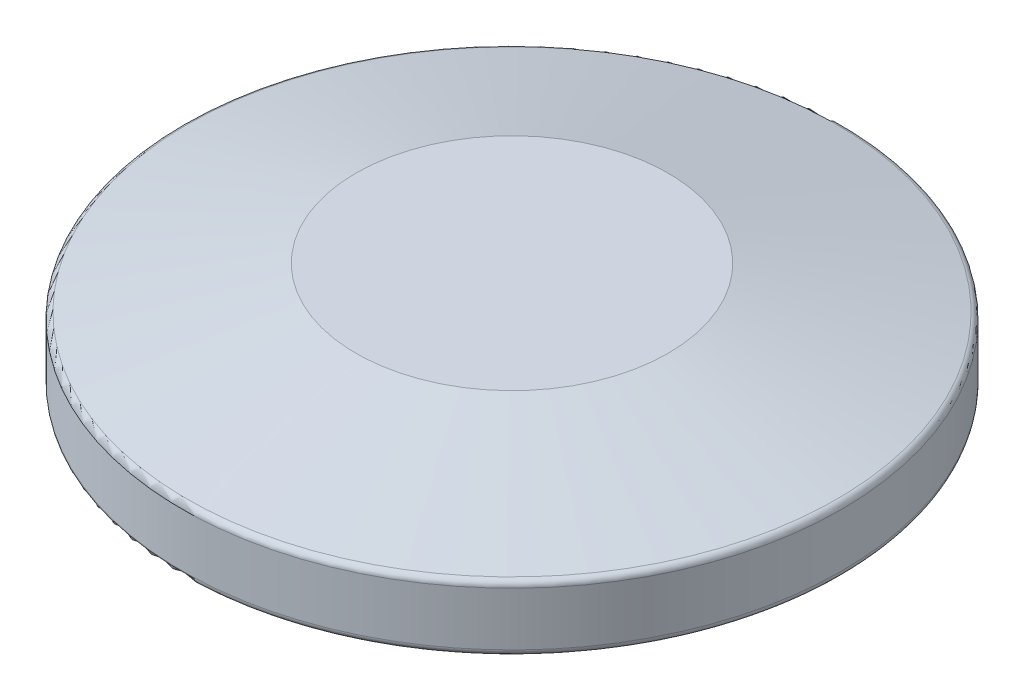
ISO-10303-21;
HEADER;
FILE_DESCRIPTION(('STEP AP214'),'2;1');
FILE_NAME('part.step','',(''),(''),'','','');
FILE_SCHEMA(('AUTOMOTIVE_DESIGN { 1 0 10303 214 1 1 1 1 }'));
ENDSEC;
DATA;
#1=APPLICATION_CONTEXT('core data for automotive mechanical design processes');
#2=APPLICATION_PROTOCOL_DEFINITION('international standard','automotive_design',2000,#1);
#3=PRODUCT_CONTEXT('',#1,'mechanical');
#4=PRODUCT('Part','Part','',(#3));
#5=PRODUCT_RELATED_PRODUCT_CATEGORY('part','',(#4));
#6=PRODUCT_DEFINITION_FORMATION('','',#4);
#7=PRODUCT_DEFINITION_CONTEXT('part definition',#1,'design');
#8=PRODUCT_DEFINITION('design','',#6,#7);
#9=PRODUCT_DEFINITION_SHAPE('','',#8);
#10=(LENGTH_UNIT() NAMED_UNIT(*) SI_UNIT(.MILLI.,.METRE.));
#11=(NAMED_UNIT(*) PLANE_ANGLE_UNIT() SI_UNIT($,.RADIAN.));
#12=(NAMED_UNIT(*) SI_UNIT($,.STERADIAN.) SOLID_ANGLE_UNIT());
#13=UNCERTAINTY_MEASURE_WITH_UNIT(LENGTH_MEASURE(1.E-05),#10,'distance_accuracy_value','');
#14=(GEOMETRIC_REPRESENTATION_CONTEXT(3) GLOBAL_UNCERTAINTY_ASSIGNED_CONTEXT((#13)) GLOBAL_UNIT_ASSIGNED_CONTEXT((#10,
#11,#12)) REPRESENTATION_CONTEXT('',''));
#15=CARTESIAN_POINT('',(0.,0.,0.));
#16=DIRECTION('',(0.,0.,1.));
#17=DIRECTION('',(1.,0.,0.));
#18=AXIS2_PLACEMENT_3D('',#15,#16,#17);
#19=CARTESIAN_POINT('',(0.,0.1,0.));
#20=DIRECTION('',(0.,1.,0.));
#21=DIRECTION('',(-1.,0.,0.));
#22=AXIS2_PLACEMENT_3D('',#19,#20,#21);
#23=TOROIDAL_SURFACE('',#22,3.525,0.1);
#24=CARTESIAN_POINT('',(0.,0.1,0.));
#25=DIRECTION('',(0.,1.,0.));
#26=DIRECTION('',(-1.,0.,0.));
#27=AXIS2_PLACEMENT_3D('',#24,#25,#26);
#28=CIRCLE('',#27,3.625);
#29=CARTESIAN_POINT('',(-3.625,0.1,0.));
#30=VERTEX_POINT('',#29);
#31=EDGE_CURVE('E52',#30,#30,#28,.T.);
#32=ORIENTED_EDGE('',*,*,#31,.F.);
#33=EDGE_LOOP('',(#32));
#34=FACE_BOUND('',#33,.T.);
#35=CARTESIAN_POINT('',(0.,0.,0.));
#36=DIRECTION('',(0.,1.,0.));
#37=DIRECTION('',(-1.,0.,0.));
#38=AXIS2_PLACEMENT_3D('',#35,#36,#37);
#39=CIRCLE('',#38,3.525);
#40=CARTESIAN_POINT('',(-3.525,0.,0.));
#41=VERTEX_POINT('',#40);
#42=EDGE_CURVE('E10',#41,#41,#39,.F.);
#43=ORIENTED_EDGE('',*,*,#42,.F.);
#44=EDGE_LOOP('',(#43));
#45=FACE_BOUND('',#44,.T.);
#46=ADVANCED_FACE('F45',(#34,#45),#23,.T.);
#47=CARTESIAN_POINT('',(0.,0.299999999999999,0.));
#48=DIRECTION('',(0.,1.,0.));
#49=DIRECTION('',(-1.,0.,0.));
#50=AXIS2_PLACEMENT_3D('',#47,#48,#49);
#51=TOROIDAL_SURFACE('',#50,6.5,0.3);
#52=CARTESIAN_POINT('',(0.,0.,0.));
#53=DIRECTION('',(0.,1.,0.));
#54=DIRECTION('',(-1.,0.,0.));
#55=AXIS2_PLACEMENT_3D('',#52,#53,#54);
#56=CIRCLE('',#55,6.5);
#57=CARTESIAN_POINT('',(-6.5,0.,0.));
#58=VERTEX_POINT('',#57);
#59=EDGE_CURVE('E62',#58,#58,#56,.T.);
#60=ORIENTED_EDGE('',*,*,#59,.F.);
#61=EDGE_LOOP('',(#60));
#62=FACE_BOUND('',#61,.T.);
#63=CARTESIAN_POINT('',(0.,0.299999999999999,0.));
#64=DIRECTION('',(0.,1.,0.));
#65=DIRECTION('',(-1.,0.,0.));
#66=AXIS2_PLACEMENT_3D('',#63,#64,#65);
#67=CIRCLE('',#66,6.2);
#68=CARTESIAN_POINT('',(-6.2,0.299999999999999,0.));
#69=VERTEX_POINT('',#68);
#70=EDGE_CURVE('E57',#69,#69,#67,.F.);
#71=ORIENTED_EDGE('',*,*,#70,.F.);
#72=EDGE_LOOP('',(#71));
#73=FACE_BOUND('',#72,.T.);
#74=ADVANCED_FACE('F116',(#62,#73),#51,.T.);
#75=CARTESIAN_POINT('',(0.,0.299999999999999,0.));
#76=DIRECTION('',(0.,1.,0.));
#77=DIRECTION('',(-1.,0.,0.));
#78=AXIS2_PLACEMENT_3D('',#75,#76,#77);
#79=TOROIDAL_SURFACE('',#78,14.9,0.3);
#80=CARTESIAN_POINT('',(0.,0.299999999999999,0.));
#81=DIRECTION('',(0.,1.,0.));
#82=DIRECTION('',(-1.,0.,0.));
#83=AXIS2_PLACEMENT_3D('',#80,#81,#82);
#84=CIRCLE('',#83,15.2);
#85=CARTESIAN_POINT('',(-15.2,0.299999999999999,0.));
#86=VERTEX_POINT('',#85);
#87=EDGE_CURVE('E72',#86,#86,#84,.T.);
#88=ORIENTED_EDGE('',*,*,#87,.F.);
#89=EDGE_LOOP('',(#88));
#90=FACE_BOUND('',#89,.T.);
#91=CARTESIAN_POINT('',(0.,0.,0.));
#92=DIRECTION('',(0.,1.,0.));
#93=DIRECTION('',(-1.,0.,0.));
#94=AXIS2_PLACEMENT_3D('',#91,#92,#93);
#95=CIRCLE('',#94,14.9);
#96=CARTESIAN_POINT('',(-14.9,0.,0.));
#97=VERTEX_POINT('',#96);
#98=EDGE_CURVE('E68',#97,#97,#95,.F.);
#99=ORIENTED_EDGE('',*,*,#98,.F.);
#100=EDGE_LOOP('',(#99));
#101=FACE_BOUND('',#100,.T.);
#102=ADVANCED_FACE('F112',(#90,#101),#79,.T.);
#103=CARTESIAN_POINT('',(0.,2.76576707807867,0.));
#104=DIRECTION('',(0.,1.,0.));
#105=DIRECTION('',(-1.,0.,0.));
#106=AXIS2_PLACEMENT_3D('',#103,#104,#105);
#107=TOROIDAL_SURFACE('',#106,14.9,0.3);
#108=CARTESIAN_POINT('',(0.,2.76576707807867,0.));
#109=DIRECTION('',(0.,1.,0.));
#110=DIRECTION('',(-1.,0.,0.));
#111=AXIS2_PLACEMENT_3D('',#108,#109,#110);
#112=CIRCLE('',#111,15.2);
#113=CARTESIAN_POINT('',(-15.2,2.76576707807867,0.));
#114=VERTEX_POINT('',#113);
#115=EDGE_CURVE('E80',#114,#114,#112,.F.);
#116=ORIENTED_EDGE('',*,*,#115,.F.);
#117=EDGE_LOOP('',(#116));
#118=FACE_BOUND('',#117,.T.);
#119=CARTESIAN_POINT('',(0.,3.05680982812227,0.));
#120=DIRECTION('',(0.,1.,0.));
#121=DIRECTION('',(-1.,0.,0.));
#122=AXIS2_PLACEMENT_3D('',#119,#120,#121);
#123=CIRCLE('',#122,14.9727606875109);
#124=CARTESIAN_POINT('',(-14.9727606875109,3.05680982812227,0.));
#125=VERTEX_POINT('',#124);
#126=EDGE_CURVE('E76',#125,#125,#123,.T.);
#127=ORIENTED_EDGE('',*,*,#126,.F.);
#128=EDGE_LOOP('',(#127));
#129=FACE_BOUND('',#128,.T.);
#130=ADVANCED_FACE('F102',(#118,#129),#107,.T.);
#131=CARTESIAN_POINT('',(0.,2.5,0.));
#132=DIRECTION('',(0.,-1.,0.));
#133=DIRECTION('',(1.,0.,0.));
#134=AXIS2_PLACEMENT_3D('',#131,#132,#133);
#135=PLANE('',#134);
#136=CARTESIAN_POINT('',(0.,2.5,0.));
#137=DIRECTION('',(0.,1.,0.));
#138=DIRECTION('',(-1.,0.,0.));
#139=AXIS2_PLACEMENT_3D('',#136,#137,#138);
#140=CIRCLE('',#139,3.625);
#141=CARTESIAN_POINT('',(-3.625,2.5,0.));
#142=VERTEX_POINT('',#141);
#143=EDGE_CURVE('E84',#142,#142,#140,.T.);
#144=ORIENTED_EDGE('',*,*,#143,.T.);
#145=EDGE_LOOP('',(#144));
#146=FACE_BOUND('',#145,.T.);
#147=CARTESIAN_POINT('',(0.,2.5,0.));
#148=DIRECTION('',(0.,1.,0.));
#149=DIRECTION('',(-1.,0.,0.));
#150=AXIS2_PLACEMENT_3D('',#147,#148,#149);
#151=CIRCLE('',#150,6.2);
#152=CARTESIAN_POINT('',(-6.2,2.5,0.));
#153=VERTEX_POINT('',#152);
#154=EDGE_CURVE('E92',#153,#153,#151,.T.);
#155=ORIENTED_EDGE('',*,*,#154,.F.);
#156=EDGE_LOOP('',(#155));
#157=FACE_BOUND('',#156,.T.);
#158=ADVANCED_FACE('F99',(#146,#157),#135,.T.);
#159=CARTESIAN_POINT('',(0.,5.,0.));
#160=DIRECTION('',(0.,1.,0.));
#161=DIRECTION('',(-1.,0.,0.));
#162=AXIS2_PLACEMENT_3D('',#159,#160,#161);
#163=CYLINDRICAL_SURFACE('',#162,3.625);
#164=ORIENTED_EDGE('',*,*,#31,.T.);
#165=EDGE_LOOP('',(#164));
#166=FACE_BOUND('',#165,.T.);
#167=ORIENTED_EDGE('',*,*,#143,.F.);
#168=EDGE_LOOP('',(#167));
#169=FACE_BOUND('',#168,.T.);
#170=ADVANCED_FACE('F101',(#166,#169),#163,.T.);
#171=CARTESIAN_POINT('',(0.,0.,0.));
#172=DIRECTION('',(0.,1.,0.));
#173=DIRECTION('',(-1.,0.,0.));
#174=AXIS2_PLACEMENT_3D('',#171,#172,#173);
#175=PLANE('',#174);
#176=ORIENTED_EDGE('',*,*,#42,.T.);
#177=EDGE_LOOP('',(#176));
#178=FACE_BOUND('',#177,.T.);
#179=ADVANCED_FACE('F109',(#178),#175,.F.);
#180=CARTESIAN_POINT('',(0.,5.,0.));
#181=DIRECTION('',(0.,-1.,0.));
#182=DIRECTION('',(1.,0.,0.));
#183=AXIS2_PLACEMENT_3D('',#180,#181,#182);
#184=PLANE('',#183);
#185=CARTESIAN_POINT('',(0.,5.,0.));
#186=DIRECTION('',(0.,1.,0.));
#187=DIRECTION('',(-1.,0.,0.));
#188=AXIS2_PLACEMENT_3D('',#185,#186,#187);
#189=CIRCLE('',#188,7.2);
#190=CARTESIAN_POINT('',(-7.2,5.,0.));
#191=VERTEX_POINT('',#190);
#192=EDGE_CURVE('E88',#191,#191,#189,.T.);
#193=ORIENTED_EDGE('',*,*,#192,.T.);
#194=EDGE_LOOP('',(#193));
#195=FACE_BOUND('',#194,.T.);
#196=ADVANCED_FACE('F148',(#195),#184,.F.);
#197=CARTESIAN_POINT('',(0.,3.,0.));
#198=DIRECTION('',(0.,-1.,0.));
#199=DIRECTION('',(1.,0.,0.));
#200=AXIS2_PLACEMENT_3D('',#197,#198,#199);
#201=CONICAL_SURFACE('',#200,15.2,1.32581766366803);
#202=ORIENTED_EDGE('',*,*,#126,.T.);
#203=EDGE_LOOP('',(#202));
#204=FACE_BOUND('',#203,.T.);
#205=ORIENTED_EDGE('',*,*,#192,.F.);
#206=EDGE_LOOP('',(#205));
#207=FACE_BOUND('',#206,.T.);
#208=ADVANCED_FACE('F144',(#204,#207),#201,.T.);
#209=CARTESIAN_POINT('',(0.,5.,0.));
#210=DIRECTION('',(0.,1.,0.));
#211=DIRECTION('',(-1.,0.,0.));
#212=AXIS2_PLACEMENT_3D('',#209,#210,#211);
#213=CYLINDRICAL_SURFACE('',#212,15.2);
#214=ORIENTED_EDGE('',*,*,#87,.T.);
#215=EDGE_LOOP('',(#214));
#216=FACE_BOUND('',#215,.T.);
#217=ORIENTED_EDGE('',*,*,#115,.T.);
#218=EDGE_LOOP('',(#217));
#219=FACE_BOUND('',#218,.T.);
#220=ADVANCED_FACE('F139',(#216,#219),#213,.T.);
#221=CARTESIAN_POINT('',(0.,0.,0.));
#222=DIRECTION('',(0.,1.,0.));
#223=DIRECTION('',(-1.,0.,0.));
#224=AXIS2_PLACEMENT_3D('',#221,#222,#223);
#225=PLANE('',#224);
#226=ORIENTED_EDGE('',*,*,#59,.T.);
#227=EDGE_LOOP('',(#226));
#228=FACE_BOUND('',#227,.T.);
#229=ORIENTED_EDGE('',*,*,#98,.T.);
#230=EDGE_LOOP('',(#229));
#231=FACE_BOUND('',#230,.T.);
#232=ADVANCED_FACE('F135',(#228,#231),#225,.F.);
#233=CARTESIAN_POINT('',(0.,5.,0.));
#234=DIRECTION('',(0.,1.,0.));
#235=DIRECTION('',(-1.,0.,0.));
#236=AXIS2_PLACEMENT_3D('',#233,#234,#235);
#237=CYLINDRICAL_SURFACE('',#236,6.2);
#238=ORIENTED_EDGE('',*,*,#70,.T.);
#239=EDGE_LOOP('',(#238));
#240=FACE_BOUND('',#239,.T.);
#241=ORIENTED_EDGE('',*,*,#154,.T.);
#242=EDGE_LOOP('',(#241));
#243=FACE_BOUND('',#242,.T.);
#244=ADVANCED_FACE('F97',(#240,#243),#237,.F.);
#245=CLOSED_SHELL('',(#46,#74,#102,#130,#158,#170,#179,#196,#208,#220,#232,#244));
#246=MANIFOLD_SOLID_BREP('B2',#245);
#247=ADVANCED_BREP_SHAPE_REPRESENTATION('',(#18,#246),#14);
#248=SHAPE_DEFINITION_REPRESENTATION(#9,#247);
ENDSEC;
END-ISO-10303-21;
